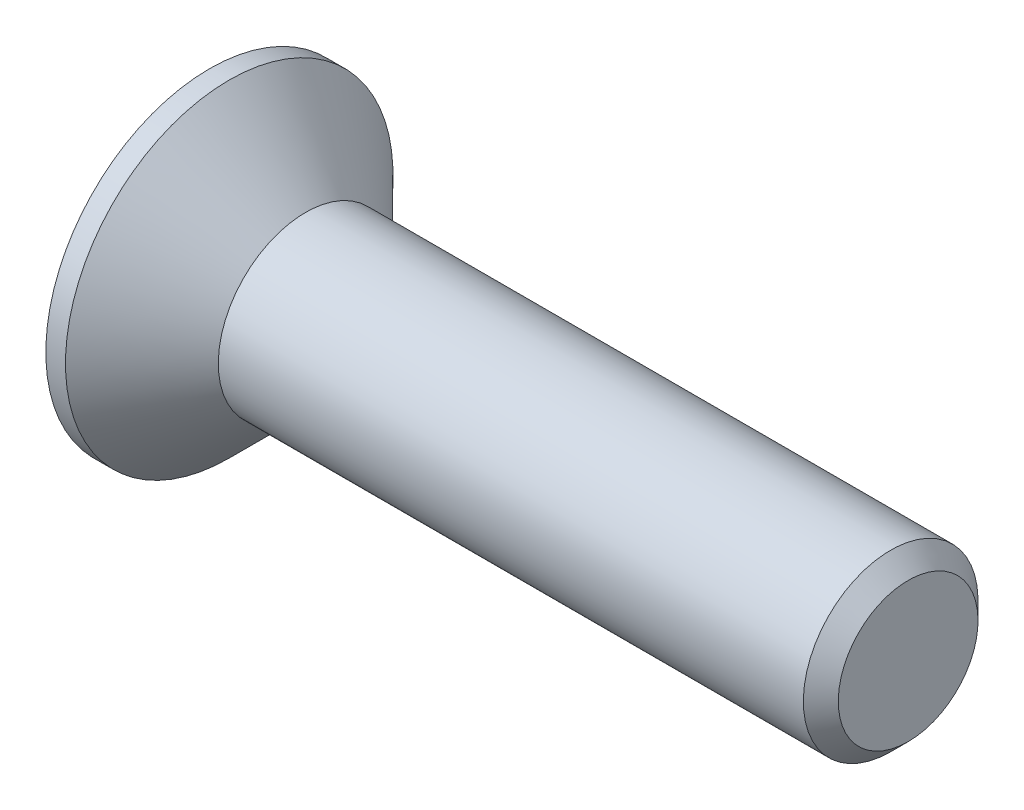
ISO-10303-21;
HEADER;
FILE_DESCRIPTION(('STEP AP214'),'2;1');
FILE_NAME('part.step','',(''),(''),'','','');
FILE_SCHEMA(('AUTOMOTIVE_DESIGN { 1 0 10303 214 1 1 1 1 }'));
ENDSEC;
DATA;
#1=APPLICATION_CONTEXT('core data for automotive mechanical design processes');
#2=APPLICATION_PROTOCOL_DEFINITION('international standard','automotive_design',2000,#1);
#3=PRODUCT_CONTEXT('',#1,'mechanical');
#4=PRODUCT('Part','Part','',(#3));
#5=PRODUCT_RELATED_PRODUCT_CATEGORY('part','',(#4));
#6=PRODUCT_DEFINITION_FORMATION('','',#4);
#7=PRODUCT_DEFINITION_CONTEXT('part definition',#1,'design');
#8=PRODUCT_DEFINITION('design','',#6,#7);
#9=PRODUCT_DEFINITION_SHAPE('','',#8);
#10=(LENGTH_UNIT() NAMED_UNIT(*) SI_UNIT(.MILLI.,.METRE.));
#11=(NAMED_UNIT(*) PLANE_ANGLE_UNIT() SI_UNIT($,.RADIAN.));
#12=(NAMED_UNIT(*) SI_UNIT($,.STERADIAN.) SOLID_ANGLE_UNIT());
#13=UNCERTAINTY_MEASURE_WITH_UNIT(LENGTH_MEASURE(1.E-05),#10,'distance_accuracy_value','');
#14=(GEOMETRIC_REPRESENTATION_CONTEXT(3) GLOBAL_UNCERTAINTY_ASSIGNED_CONTEXT((#13)) GLOBAL_UNIT_ASSIGNED_CONTEXT((#10,
#11,#12)) REPRESENTATION_CONTEXT('',''));
#15=CARTESIAN_POINT('',(0.,0.,0.));
#16=DIRECTION('',(0.,0.,1.));
#17=DIRECTION('',(1.,0.,0.));
#18=AXIS2_PLACEMENT_3D('',#15,#16,#17);
#19=CARTESIAN_POINT('',(0.,0.,0.));
#20=DIRECTION('',(-1.,0.,0.));
#21=DIRECTION('',(0.,-1.,0.));
#22=AXIS2_PLACEMENT_3D('',#19,#20,#21);
#23=CONICAL_SURFACE('',#22,2.,0.78539816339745);
#24=CARTESIAN_POINT('',(-1.74999999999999,0.,0.));
#25=DIRECTION('',(-1.,0.,0.));
#26=DIRECTION('',(0.,-1.,0.));
#27=AXIS2_PLACEMENT_3D('',#24,#25,#26);
#28=CIRCLE('',#27,3.75);
#29=CARTESIAN_POINT('',(-1.74999999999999,-3.75,0.));
#30=VERTEX_POINT('',#29);
#31=EDGE_CURVE('E189',#30,#30,#28,.T.);
#32=ORIENTED_EDGE('',*,*,#31,.F.);
#33=EDGE_LOOP('',(#32));
#34=FACE_BOUND('',#33,.T.);
#35=CARTESIAN_POINT('',(0.,0.,0.));
#36=DIRECTION('',(-1.,0.,0.));
#37=DIRECTION('',(0.,-1.,0.));
#38=AXIS2_PLACEMENT_3D('',#35,#36,#37);
#39=CIRCLE('',#38,2.);
#40=CARTESIAN_POINT('',(0.,-2.,0.));
#41=VERTEX_POINT('',#40);
#42=EDGE_CURVE('E212',#41,#41,#39,.T.);
#43=ORIENTED_EDGE('',*,*,#42,.T.);
#44=EDGE_LOOP('',(#43));
#45=FACE_BOUND('',#44,.T.);
#46=ADVANCED_FACE('F33',(#34,#45),#23,.T.);
#47=CARTESIAN_POINT('',(-2.2,0.,0.));
#48=DIRECTION('',(-1.,0.,0.));
#49=DIRECTION('',(0.,-1.,0.));
#50=AXIS2_PLACEMENT_3D('',#47,#48,#49);
#51=CYLINDRICAL_SURFACE('',#50,2.);
#52=CARTESIAN_POINT('',(13.4,0.,0.));
#53=DIRECTION('',(-1.,0.,0.));
#54=DIRECTION('',(0.,-1.,0.));
#55=AXIS2_PLACEMENT_3D('',#52,#53,#54);
#56=CIRCLE('',#55,2.);
#57=CARTESIAN_POINT('',(13.4,-2.,0.));
#58=VERTEX_POINT('',#57);
#59=EDGE_CURVE('E41',#58,#58,#56,.T.);
#60=ORIENTED_EDGE('',*,*,#59,.T.);
#61=EDGE_LOOP('',(#60));
#62=FACE_BOUND('',#61,.T.);
#63=ORIENTED_EDGE('',*,*,#42,.F.);
#64=EDGE_LOOP('',(#63));
#65=FACE_BOUND('',#64,.T.);
#66=ADVANCED_FACE('F217',(#62,#65),#51,.T.);
#67=CARTESIAN_POINT('',(13.8,0.,0.));
#68=DIRECTION('',(-1.,0.,0.));
#69=DIRECTION('',(0.,-1.,0.));
#70=AXIS2_PLACEMENT_3D('',#67,#68,#69);
#71=PLANE('',#70);
#72=CARTESIAN_POINT('',(13.8,0.,0.));
#73=DIRECTION('',(-1.,0.,0.));
#74=DIRECTION('',(0.,-1.,0.));
#75=AXIS2_PLACEMENT_3D('',#72,#73,#74);
#76=CIRCLE('',#75,1.6);
#77=CARTESIAN_POINT('',(13.8,-1.6,0.));
#78=VERTEX_POINT('',#77);
#79=EDGE_CURVE('E11',#78,#78,#76,.F.);
#80=ORIENTED_EDGE('',*,*,#79,.T.);
#81=EDGE_LOOP('',(#80));
#82=FACE_BOUND('',#81,.T.);
#83=ADVANCED_FACE('F239',(#82),#71,.F.);
#84=CARTESIAN_POINT('',(-2.2,3.75,0.));
#85=DIRECTION('',(1.,0.,0.));
#86=DIRECTION('',(0.,1.,0.));
#87=AXIS2_PLACEMENT_3D('',#84,#85,#86);
#88=PLANE('',#87);
#89=DIRECTION('',(0.,0.,-1.));
#90=VECTOR('',#89,1.);
#91=CARTESIAN_POINT('',(-2.2,0.55,-2.2));
#92=LINE('',#91,#90);
#93=CARTESIAN_POINT('',(-2.2,0.55,-0.55));
#94=VERTEX_POINT('',#93);
#95=CARTESIAN_POINT('',(-2.2,0.55,-2.2));
#96=VERTEX_POINT('',#95);
#97=EDGE_CURVE('E158',#94,#96,#92,.T.);
#98=ORIENTED_EDGE('',*,*,#97,.F.);
#99=DIRECTION('',(0.,-1.,0.));
#100=VECTOR('',#99,1.);
#101=CARTESIAN_POINT('',(-2.2,0.55,-0.55));
#102=LINE('',#101,#100);
#103=CARTESIAN_POINT('',(-2.2,2.2,-0.55));
#104=VERTEX_POINT('',#103);
#105=EDGE_CURVE('E48',#104,#94,#102,.T.);
#106=ORIENTED_EDGE('',*,*,#105,.F.);
#107=DIRECTION('',(0.,0.,-1.));
#108=VECTOR('',#107,1.);
#109=CARTESIAN_POINT('',(-2.2,2.2,-0.55));
#110=LINE('',#109,#108);
#111=CARTESIAN_POINT('',(-2.2,2.2,0.55));
#112=VERTEX_POINT('',#111);
#113=EDGE_CURVE('E185',#112,#104,#110,.T.);
#114=ORIENTED_EDGE('',*,*,#113,.F.);
#115=DIRECTION('',(0.,1.,0.));
#116=VECTOR('',#115,1.);
#117=CARTESIAN_POINT('',(-2.2,2.2,0.55));
#118=LINE('',#117,#116);
#119=CARTESIAN_POINT('',(-2.2,0.55,0.55));
#120=VERTEX_POINT('',#119);
#121=EDGE_CURVE('E183',#120,#112,#118,.T.);
#122=ORIENTED_EDGE('',*,*,#121,.F.);
#123=DIRECTION('',(0.,0.,-1.));
#124=VECTOR('',#123,1.);
#125=CARTESIAN_POINT('',(-2.2,0.55,0.55));
#126=LINE('',#125,#124);
#127=CARTESIAN_POINT('',(-2.2,0.55,2.2));
#128=VERTEX_POINT('',#127);
#129=EDGE_CURVE('E132',#128,#120,#126,.T.);
#130=ORIENTED_EDGE('',*,*,#129,.F.);
#131=DIRECTION('',(0.,1.,0.));
#132=VECTOR('',#131,1.);
#133=CARTESIAN_POINT('',(-2.2,0.55,2.2));
#134=LINE('',#133,#132);
#135=CARTESIAN_POINT('',(-2.2,-0.55,2.2));
#136=VERTEX_POINT('',#135);
#137=EDGE_CURVE('E179',#136,#128,#134,.T.);
#138=ORIENTED_EDGE('',*,*,#137,.F.);
#139=DIRECTION('',(0.,0.,1.));
#140=VECTOR('',#139,1.);
#141=CARTESIAN_POINT('',(-2.2,-0.55,2.2));
#142=LINE('',#141,#140);
#143=CARTESIAN_POINT('',(-2.2,-0.55,0.55));
#144=VERTEX_POINT('',#143);
#145=EDGE_CURVE('E176',#144,#136,#142,.T.);
#146=ORIENTED_EDGE('',*,*,#145,.F.);
#147=DIRECTION('',(0.,1.,0.));
#148=VECTOR('',#147,1.);
#149=CARTESIAN_POINT('',(-2.2,-0.55,0.55));
#150=LINE('',#149,#148);
#151=CARTESIAN_POINT('',(-2.2,-2.2,0.55));
#152=VERTEX_POINT('',#151);
#153=EDGE_CURVE('E173',#152,#144,#150,.T.);
#154=ORIENTED_EDGE('',*,*,#153,.F.);
#155=DIRECTION('',(0.,0.,1.));
#156=VECTOR('',#155,1.);
#157=CARTESIAN_POINT('',(-2.2,-2.2,0.55));
#158=LINE('',#157,#156);
#159=CARTESIAN_POINT('',(-2.2,-2.2,-0.55));
#160=VERTEX_POINT('',#159);
#161=EDGE_CURVE('E170',#160,#152,#158,.T.);
#162=ORIENTED_EDGE('',*,*,#161,.F.);
#163=DIRECTION('',(0.,-1.,0.));
#164=VECTOR('',#163,1.);
#165=CARTESIAN_POINT('',(-2.2,-2.2,-0.55));
#166=LINE('',#165,#164);
#167=CARTESIAN_POINT('',(-2.2,-0.55,-0.55));
#168=VERTEX_POINT('',#167);
#169=EDGE_CURVE('E167',#168,#160,#166,.T.);
#170=ORIENTED_EDGE('',*,*,#169,.F.);
#171=DIRECTION('',(0.,0.,1.));
#172=VECTOR('',#171,1.);
#173=CARTESIAN_POINT('',(-2.2,-0.55,-0.55));
#174=LINE('',#173,#172);
#175=CARTESIAN_POINT('',(-2.2,-0.55,-2.2));
#176=VERTEX_POINT('',#175);
#177=EDGE_CURVE('E164',#176,#168,#174,.T.);
#178=ORIENTED_EDGE('',*,*,#177,.F.);
#179=DIRECTION('',(0.,-1.,0.));
#180=VECTOR('',#179,1.);
#181=CARTESIAN_POINT('',(-2.2,-0.55,-2.2));
#182=LINE('',#181,#180);
#183=EDGE_CURVE('E161',#96,#176,#182,.T.);
#184=ORIENTED_EDGE('',*,*,#183,.F.);
#185=EDGE_LOOP('',(#98,#106,#114,#122,#130,#138,#146,#154,#162,#170,#178,#184));
#186=FACE_BOUND('',#185,.T.);
#187=CARTESIAN_POINT('',(-2.2,0.,0.));
#188=DIRECTION('',(-1.,0.,0.));
#189=DIRECTION('',(0.,-1.,0.));
#190=AXIS2_PLACEMENT_3D('',#187,#188,#189);
#191=CIRCLE('',#190,3.75);
#192=CARTESIAN_POINT('',(-2.2,-3.75,0.));
#193=VERTEX_POINT('',#192);
#194=EDGE_CURVE('E209',#193,#193,#191,.T.);
#195=ORIENTED_EDGE('',*,*,#194,.T.);
#196=EDGE_LOOP('',(#195));
#197=FACE_BOUND('',#196,.T.);
#198=ADVANCED_FACE('F230',(#186,#197),#88,.F.);
#199=CARTESIAN_POINT('',(-2.2,0.,0.));
#200=DIRECTION('',(-1.,0.,0.));
#201=DIRECTION('',(0.,-1.,0.));
#202=AXIS2_PLACEMENT_3D('',#199,#200,#201);
#203=CYLINDRICAL_SURFACE('',#202,3.75);
#204=ORIENTED_EDGE('',*,*,#194,.F.);
#205=EDGE_LOOP('',(#204));
#206=FACE_BOUND('',#205,.T.);
#207=ORIENTED_EDGE('',*,*,#31,.T.);
#208=EDGE_LOOP('',(#207));
#209=FACE_BOUND('',#208,.T.);
#210=ADVANCED_FACE('F222',(#206,#209),#203,.T.);
#211=CARTESIAN_POINT('',(13.4,0.,0.));
#212=DIRECTION('',(-1.,0.,0.));
#213=DIRECTION('',(0.,-1.,0.));
#214=AXIS2_PLACEMENT_3D('',#211,#212,#213);
#215=CONICAL_SURFACE('',#214,2.,0.785398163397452);
#216=ORIENTED_EDGE('',*,*,#79,.F.);
#217=EDGE_LOOP('',(#216));
#218=FACE_BOUND('',#217,.T.);
#219=ORIENTED_EDGE('',*,*,#59,.F.);
#220=EDGE_LOOP('',(#219));
#221=FACE_BOUND('',#220,.T.);
#222=ADVANCED_FACE('F35',(#218,#221),#215,.T.);
#223=CARTESIAN_POINT('',(-0.3,0.55,-0.55));
#224=DIRECTION('',(0.,0.,-1.));
#225=DIRECTION('',(-1.,0.,0.));
#226=AXIS2_PLACEMENT_3D('',#223,#224,#225);
#227=PLANE('',#226);
#228=ORIENTED_EDGE('',*,*,#105,.T.);
#229=DIRECTION('',(-1.,0.,0.));
#230=VECTOR('',#229,1.);
#231=CARTESIAN_POINT('',(-0.3,0.55,-0.55));
#232=LINE('',#231,#230);
#233=CARTESIAN_POINT('',(-0.3,0.55,-0.55));
#234=VERTEX_POINT('',#233);
#235=EDGE_CURVE('E96',#234,#94,#232,.T.);
#236=ORIENTED_EDGE('',*,*,#235,.F.);
#237=DIRECTION('',(0.,-1.,0.));
#238=VECTOR('',#237,1.);
#239=CARTESIAN_POINT('',(-0.3,0.55,-0.55));
#240=LINE('',#239,#238);
#241=CARTESIAN_POINT('',(-0.3,2.2,-0.55));
#242=VERTEX_POINT('',#241);
#243=EDGE_CURVE('E187',#242,#234,#240,.T.);
#244=ORIENTED_EDGE('',*,*,#243,.F.);
#245=DIRECTION('',(-1.,0.,0.));
#246=VECTOR('',#245,1.);
#247=CARTESIAN_POINT('',(-0.3,2.2,-0.55));
#248=LINE('',#247,#246);
#249=EDGE_CURVE('E56',#242,#104,#248,.T.);
#250=ORIENTED_EDGE('',*,*,#249,.T.);
#251=EDGE_LOOP('',(#228,#236,#244,#250));
#252=FACE_BOUND('',#251,.T.);
#253=ADVANCED_FACE('F221',(#252),#227,.F.);
#254=CARTESIAN_POINT('',(-0.3,2.2,-0.55));
#255=DIRECTION('',(0.,1.,0.));
#256=DIRECTION('',(-1.,0.,0.));
#257=AXIS2_PLACEMENT_3D('',#254,#255,#256);
#258=PLANE('',#257);
#259=ORIENTED_EDGE('',*,*,#113,.T.);
#260=ORIENTED_EDGE('',*,*,#249,.F.);
#261=DIRECTION('',(0.,0.,-1.));
#262=VECTOR('',#261,1.);
#263=CARTESIAN_POINT('',(-0.3,2.2,-0.55));
#264=LINE('',#263,#262);
#265=CARTESIAN_POINT('',(-0.3,2.2,0.55));
#266=VERTEX_POINT('',#265);
#267=EDGE_CURVE('E144',#266,#242,#264,.T.);
#268=ORIENTED_EDGE('',*,*,#267,.F.);
#269=DIRECTION('',(-1.,0.,0.));
#270=VECTOR('',#269,1.);
#271=CARTESIAN_POINT('',(-0.3,2.2,0.55));
#272=LINE('',#271,#270);
#273=EDGE_CURVE('E136',#266,#112,#272,.T.);
#274=ORIENTED_EDGE('',*,*,#273,.T.);
#275=EDGE_LOOP('',(#259,#260,#268,#274));
#276=FACE_BOUND('',#275,.T.);
#277=ADVANCED_FACE('F228',(#276),#258,.F.);
#278=CARTESIAN_POINT('',(-0.3,2.2,0.55));
#279=DIRECTION('',(0.,0.,1.));
#280=DIRECTION('',(1.,0.,0.));
#281=AXIS2_PLACEMENT_3D('',#278,#279,#280);
#282=PLANE('',#281);
#283=ORIENTED_EDGE('',*,*,#121,.T.);
#284=ORIENTED_EDGE('',*,*,#273,.F.);
#285=DIRECTION('',(0.,1.,0.));
#286=VECTOR('',#285,1.);
#287=CARTESIAN_POINT('',(-0.3,2.2,0.55));
#288=LINE('',#287,#286);
#289=CARTESIAN_POINT('',(-0.3,0.55,0.55));
#290=VERTEX_POINT('',#289);
#291=EDGE_CURVE('E140',#290,#266,#288,.T.);
#292=ORIENTED_EDGE('',*,*,#291,.F.);
#293=DIRECTION('',(-1.,0.,0.));
#294=VECTOR('',#293,1.);
#295=CARTESIAN_POINT('',(-0.3,0.55,0.55));
#296=LINE('',#295,#294);
#297=EDGE_CURVE('E125',#290,#120,#296,.T.);
#298=ORIENTED_EDGE('',*,*,#297,.T.);
#299=EDGE_LOOP('',(#283,#284,#292,#298));
#300=FACE_BOUND('',#299,.T.);
#301=ADVANCED_FACE('F141',(#300),#282,.F.);
#302=CARTESIAN_POINT('',(-0.3,0.55,0.55));
#303=DIRECTION('',(0.,1.,0.));
#304=DIRECTION('',(-1.,0.,0.));
#305=AXIS2_PLACEMENT_3D('',#302,#303,#304);
#306=PLANE('',#305);
#307=ORIENTED_EDGE('',*,*,#129,.T.);
#308=ORIENTED_EDGE('',*,*,#297,.F.);
#309=DIRECTION('',(0.,0.,-1.));
#310=VECTOR('',#309,1.);
#311=CARTESIAN_POINT('',(-0.3,0.55,0.55));
#312=LINE('',#311,#310);
#313=CARTESIAN_POINT('',(-0.3,0.55,2.2));
#314=VERTEX_POINT('',#313);
#315=EDGE_CURVE('E129',#314,#290,#312,.T.);
#316=ORIENTED_EDGE('',*,*,#315,.F.);
#317=DIRECTION('',(-1.,0.,0.));
#318=VECTOR('',#317,1.);
#319=CARTESIAN_POINT('',(-0.3,0.55,2.2));
#320=LINE('',#319,#318);
#321=EDGE_CURVE('E137',#314,#128,#320,.T.);
#322=ORIENTED_EDGE('',*,*,#321,.T.);
#323=EDGE_LOOP('',(#307,#308,#316,#322));
#324=FACE_BOUND('',#323,.T.);
#325=ADVANCED_FACE('F127',(#324),#306,.F.);
#326=CARTESIAN_POINT('',(-0.3,0.55,2.2));
#327=DIRECTION('',(0.,0.,1.));
#328=DIRECTION('',(1.,0.,0.));
#329=AXIS2_PLACEMENT_3D('',#326,#327,#328);
#330=PLANE('',#329);
#331=ORIENTED_EDGE('',*,*,#137,.T.);
#332=ORIENTED_EDGE('',*,*,#321,.F.);
#333=DIRECTION('',(0.,1.,0.));
#334=VECTOR('',#333,1.);
#335=CARTESIAN_POINT('',(-0.3,0.55,2.2));
#336=LINE('',#335,#334);
#337=CARTESIAN_POINT('',(-0.3,-0.55,2.2));
#338=VERTEX_POINT('',#337);
#339=EDGE_CURVE('E150',#338,#314,#336,.T.);
#340=ORIENTED_EDGE('',*,*,#339,.F.);
#341=DIRECTION('',(-1.,0.,0.));
#342=VECTOR('',#341,1.);
#343=CARTESIAN_POINT('',(-0.3,-0.55,2.2));
#344=LINE('',#343,#342);
#345=EDGE_CURVE('E192',#338,#136,#344,.T.);
#346=ORIENTED_EDGE('',*,*,#345,.T.);
#347=EDGE_LOOP('',(#331,#332,#340,#346));
#348=FACE_BOUND('',#347,.T.);
#349=ADVANCED_FACE('F277',(#348),#330,.F.);
#350=CARTESIAN_POINT('',(-0.3,-0.55,2.2));
#351=DIRECTION('',(0.,-1.,0.));
#352=DIRECTION('',(1.,0.,0.));
#353=AXIS2_PLACEMENT_3D('',#350,#351,#352);
#354=PLANE('',#353);
#355=ORIENTED_EDGE('',*,*,#145,.T.);
#356=ORIENTED_EDGE('',*,*,#345,.F.);
#357=DIRECTION('',(0.,0.,1.));
#358=VECTOR('',#357,1.);
#359=CARTESIAN_POINT('',(-0.3,-0.55,2.2));
#360=LINE('',#359,#358);
#361=CARTESIAN_POINT('',(-0.3,-0.55,0.55));
#362=VERTEX_POINT('',#361);
#363=EDGE_CURVE('E152',#362,#338,#360,.T.);
#364=ORIENTED_EDGE('',*,*,#363,.F.);
#365=DIRECTION('',(-1.,0.,0.));
#366=VECTOR('',#365,1.);
#367=CARTESIAN_POINT('',(-0.3,-0.55,0.55));
#368=LINE('',#367,#366);
#369=EDGE_CURVE('E194',#362,#144,#368,.T.);
#370=ORIENTED_EDGE('',*,*,#369,.T.);
#371=EDGE_LOOP('',(#355,#356,#364,#370));
#372=FACE_BOUND('',#371,.T.);
#373=ADVANCED_FACE('F273',(#372),#354,.F.);
#374=CARTESIAN_POINT('',(-0.3,-0.55,0.55));
#375=DIRECTION('',(0.,0.,1.));
#376=DIRECTION('',(1.,0.,0.));
#377=AXIS2_PLACEMENT_3D('',#374,#375,#376);
#378=PLANE('',#377);
#379=ORIENTED_EDGE('',*,*,#153,.T.);
#380=ORIENTED_EDGE('',*,*,#369,.F.);
#381=DIRECTION('',(0.,1.,0.));
#382=VECTOR('',#381,1.);
#383=CARTESIAN_POINT('',(-0.3,-0.55,0.55));
#384=LINE('',#383,#382);
#385=CARTESIAN_POINT('',(-0.3,-2.2,0.55));
#386=VERTEX_POINT('',#385);
#387=EDGE_CURVE('E422',#386,#362,#384,.T.);
#388=ORIENTED_EDGE('',*,*,#387,.F.);
#389=DIRECTION('',(-1.,0.,0.));
#390=VECTOR('',#389,1.);
#391=CARTESIAN_POINT('',(-0.3,-2.2,0.55));
#392=LINE('',#391,#390);
#393=EDGE_CURVE('E196',#386,#152,#392,.T.);
#394=ORIENTED_EDGE('',*,*,#393,.T.);
#395=EDGE_LOOP('',(#379,#380,#388,#394));
#396=FACE_BOUND('',#395,.T.);
#397=ADVANCED_FACE('F269',(#396),#378,.F.);
#398=CARTESIAN_POINT('',(-0.3,-2.2,0.55));
#399=DIRECTION('',(0.,-1.,0.));
#400=DIRECTION('',(1.,0.,0.));
#401=AXIS2_PLACEMENT_3D('',#398,#399,#400);
#402=PLANE('',#401);
#403=ORIENTED_EDGE('',*,*,#161,.T.);
#404=ORIENTED_EDGE('',*,*,#393,.F.);
#405=DIRECTION('',(0.,0.,1.));
#406=VECTOR('',#405,1.);
#407=CARTESIAN_POINT('',(-0.3,-2.2,0.55));
#408=LINE('',#407,#406);
#409=CARTESIAN_POINT('',(-0.3,-2.2,-0.55));
#410=VERTEX_POINT('',#409);
#411=EDGE_CURVE('E419',#410,#386,#408,.T.);
#412=ORIENTED_EDGE('',*,*,#411,.F.);
#413=DIRECTION('',(-1.,0.,0.));
#414=VECTOR('',#413,1.);
#415=CARTESIAN_POINT('',(-0.3,-2.2,-0.55));
#416=LINE('',#415,#414);
#417=EDGE_CURVE('E198',#410,#160,#416,.T.);
#418=ORIENTED_EDGE('',*,*,#417,.T.);
#419=EDGE_LOOP('',(#403,#404,#412,#418));
#420=FACE_BOUND('',#419,.T.);
#421=ADVANCED_FACE('F265',(#420),#402,.F.);
#422=CARTESIAN_POINT('',(-0.3,-2.2,-0.55));
#423=DIRECTION('',(0.,0.,-1.));
#424=DIRECTION('',(-1.,0.,0.));
#425=AXIS2_PLACEMENT_3D('',#422,#423,#424);
#426=PLANE('',#425);
#427=ORIENTED_EDGE('',*,*,#169,.T.);
#428=ORIENTED_EDGE('',*,*,#417,.F.);
#429=DIRECTION('',(0.,-1.,0.));
#430=VECTOR('',#429,1.);
#431=CARTESIAN_POINT('',(-0.3,-2.2,-0.55));
#432=LINE('',#431,#430);
#433=CARTESIAN_POINT('',(-0.3,-0.55,-0.55));
#434=VERTEX_POINT('',#433);
#435=EDGE_CURVE('E416',#434,#410,#432,.T.);
#436=ORIENTED_EDGE('',*,*,#435,.F.);
#437=DIRECTION('',(-1.,0.,0.));
#438=VECTOR('',#437,1.);
#439=CARTESIAN_POINT('',(-0.3,-0.55,-0.55));
#440=LINE('',#439,#438);
#441=EDGE_CURVE('E200',#434,#168,#440,.T.);
#442=ORIENTED_EDGE('',*,*,#441,.T.);
#443=EDGE_LOOP('',(#427,#428,#436,#442));
#444=FACE_BOUND('',#443,.T.);
#445=ADVANCED_FACE('F261',(#444),#426,.F.);
#446=CARTESIAN_POINT('',(-0.3,-0.55,-0.55));
#447=DIRECTION('',(0.,-1.,0.));
#448=DIRECTION('',(1.,0.,0.));
#449=AXIS2_PLACEMENT_3D('',#446,#447,#448);
#450=PLANE('',#449);
#451=ORIENTED_EDGE('',*,*,#177,.T.);
#452=ORIENTED_EDGE('',*,*,#441,.F.);
#453=DIRECTION('',(0.,0.,1.));
#454=VECTOR('',#453,1.);
#455=CARTESIAN_POINT('',(-0.3,-0.55,-0.55));
#456=LINE('',#455,#454);
#457=CARTESIAN_POINT('',(-0.3,-0.55,-2.2));
#458=VERTEX_POINT('',#457);
#459=EDGE_CURVE('E413',#458,#434,#456,.T.);
#460=ORIENTED_EDGE('',*,*,#459,.F.);
#461=DIRECTION('',(-1.,0.,0.));
#462=VECTOR('',#461,1.);
#463=CARTESIAN_POINT('',(-0.3,-0.55,-2.2));
#464=LINE('',#463,#462);
#465=EDGE_CURVE('E202',#458,#176,#464,.T.);
#466=ORIENTED_EDGE('',*,*,#465,.T.);
#467=EDGE_LOOP('',(#451,#452,#460,#466));
#468=FACE_BOUND('',#467,.T.);
#469=ADVANCED_FACE('F257',(#468),#450,.F.);
#470=CARTESIAN_POINT('',(-0.3,-0.55,-2.2));
#471=DIRECTION('',(0.,0.,-1.));
#472=DIRECTION('',(-1.,0.,0.));
#473=AXIS2_PLACEMENT_3D('',#470,#471,#472);
#474=PLANE('',#473);
#475=ORIENTED_EDGE('',*,*,#183,.T.);
#476=ORIENTED_EDGE('',*,*,#465,.F.);
#477=DIRECTION('',(0.,-1.,0.));
#478=VECTOR('',#477,1.);
#479=CARTESIAN_POINT('',(-0.3,-0.55,-2.2));
#480=LINE('',#479,#478);
#481=CARTESIAN_POINT('',(-0.3,0.55,-2.2));
#482=VERTEX_POINT('',#481);
#483=EDGE_CURVE('E408',#482,#458,#480,.T.);
#484=ORIENTED_EDGE('',*,*,#483,.F.);
#485=DIRECTION('',(-1.,0.,0.));
#486=VECTOR('',#485,1.);
#487=CARTESIAN_POINT('',(-0.3,0.55,-2.2));
#488=LINE('',#487,#486);
#489=EDGE_CURVE('E204',#482,#96,#488,.T.);
#490=ORIENTED_EDGE('',*,*,#489,.T.);
#491=EDGE_LOOP('',(#475,#476,#484,#490));
#492=FACE_BOUND('',#491,.T.);
#493=ADVANCED_FACE('F253',(#492),#474,.F.);
#494=CARTESIAN_POINT('',(-0.3,0.55,-2.2));
#495=DIRECTION('',(0.,1.,0.));
#496=DIRECTION('',(-1.,0.,0.));
#497=AXIS2_PLACEMENT_3D('',#494,#495,#496);
#498=PLANE('',#497);
#499=ORIENTED_EDGE('',*,*,#97,.T.);
#500=ORIENTED_EDGE('',*,*,#489,.F.);
#501=DIRECTION('',(0.,0.,-1.));
#502=VECTOR('',#501,1.);
#503=CARTESIAN_POINT('',(-0.3,0.55,-2.2));
#504=LINE('',#503,#502);
#505=EDGE_CURVE('E406',#234,#482,#504,.T.);
#506=ORIENTED_EDGE('',*,*,#505,.F.);
#507=ORIENTED_EDGE('',*,*,#235,.T.);
#508=EDGE_LOOP('',(#499,#500,#506,#507));
#509=FACE_BOUND('',#508,.T.);
#510=ADVANCED_FACE('F250',(#509),#498,.F.);
#511=CARTESIAN_POINT('',(-0.3,0.,0.));
#512=DIRECTION('',(1.,0.,0.));
#513=DIRECTION('',(0.,0.,-1.));
#514=AXIS2_PLACEMENT_3D('',#511,#512,#513);
#515=PLANE('',#514);
#516=ORIENTED_EDGE('',*,*,#243,.T.);
#517=ORIENTED_EDGE('',*,*,#505,.T.);
#518=ORIENTED_EDGE('',*,*,#483,.T.);
#519=ORIENTED_EDGE('',*,*,#459,.T.);
#520=ORIENTED_EDGE('',*,*,#435,.T.);
#521=ORIENTED_EDGE('',*,*,#411,.T.);
#522=ORIENTED_EDGE('',*,*,#387,.T.);
#523=ORIENTED_EDGE('',*,*,#363,.T.);
#524=ORIENTED_EDGE('',*,*,#339,.T.);
#525=ORIENTED_EDGE('',*,*,#315,.T.);
#526=ORIENTED_EDGE('',*,*,#291,.T.);
#527=ORIENTED_EDGE('',*,*,#267,.T.);
#528=EDGE_LOOP('',(#516,#517,#518,#519,#520,#521,#522,#523,#524,#525,#526,#527));
#529=FACE_BOUND('',#528,.T.);
#530=ADVANCED_FACE('F147',(#529),#515,.F.);
#531=CLOSED_SHELL('',(#46,#66,#83,#198,#210,#222,#253,#277,#301,#325,#349,#373,#397,#421,#445,
#469,#493,#510,#530));
#532=MANIFOLD_SOLID_BREP('B2',#531);
#533=ADVANCED_BREP_SHAPE_REPRESENTATION('',(#18,#532),#14);
#534=SHAPE_DEFINITION_REPRESENTATION(#9,#533);
ENDSEC;
END-ISO-10303-21;
